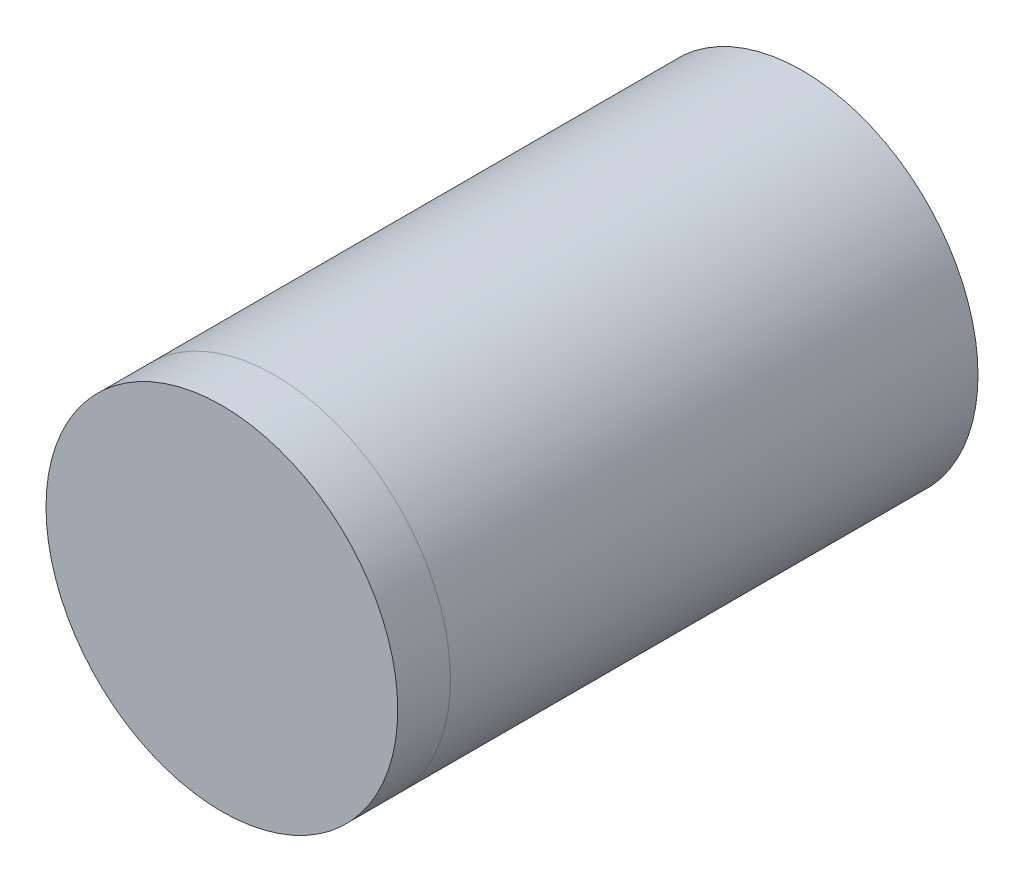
from build123d import *

# Parameters (mm, degrees)
ESQUISSECORPS_W = 5.0005
ESQUISSECORPS_H = 1.5
ESQUISSE1_W     = 5
ESQUISSE1_H     = 15


with BuildPart() as part:
    # EsquisseCorps → Base-R_volution (revolve)
    with BuildSketch(Plane(origin=(0, 0, 0), x_dir=(1, 0, 0), z_dir=(0, 1, 0)), mode=Mode.PRIVATE) as base_r_volution_sk:
        with Locations((2.50025, -15.749)):
            Rectangle(ESQUISSECORPS_W, ESQUISSECORPS_H)
    revolve(base_r_volution_sk.sketch.rotate(Axis((0, 0, 0), (0, 0, 1)), 180), axis=Axis((0, 0, 0), (0, 0, 1)))

    # Esquisse1 → Boss.-R_vol.1 (revolve)
    with BuildSketch(Plane(origin=(0, 0, 0), x_dir=(1, 0, 0), z_dir=(0, 1, 0)), mode=Mode.PRIVATE) as boss_r_vol_1_sk:
        with Locations((2.5, -7.499)):
            Rectangle(ESQUISSE1_W, ESQUISSE1_H)
    revolve(boss_r_vol_1_sk.sketch.rotate(Axis((0, 0, -0.001), (0, 0, 1)), 180), axis=Axis((0, 0, -0.001), (0, 0, 1)))


solid = part.part
